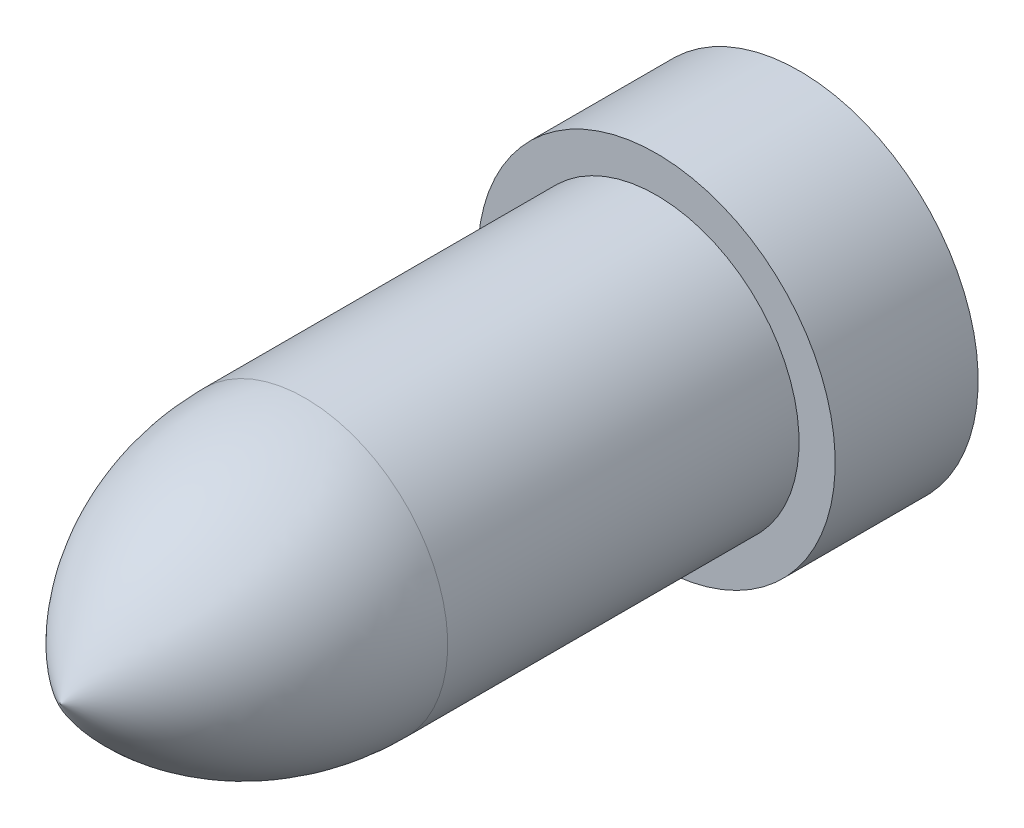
from build123d import *


with BuildPart() as part:
    # Logo3_bib1 → Revolve1 (revolve)
    with BuildSketch(Plane(origin=(0, 0, 0), x_dir=(-1, 0, 0), z_dir=(0, -1, 0))):
        with BuildLine():
            Line((4.7625, 0), (5.969, 0))
            Line((5.969, 0), (5.969, 4.7752))
            Line((5.969, 4.7752), (0, 4.7752))
            Line((0, 4.7752), (0, -10.4648))
            Line((0, -10.4648), (0, -19.910039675))
            ThreePointArc((0, -19.910039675), (3.485055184, -16.465443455), (4.7625, -11.7348))
            Line((4.7625, -11.7348), (4.7625, -10.4648))
            Line((4.7625, -10.4648), (4.7625, 0))
        make_face()
    revolve(axis=Axis((0, 0, -41.537203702), (0, 0, 1)))


solid = part.part
